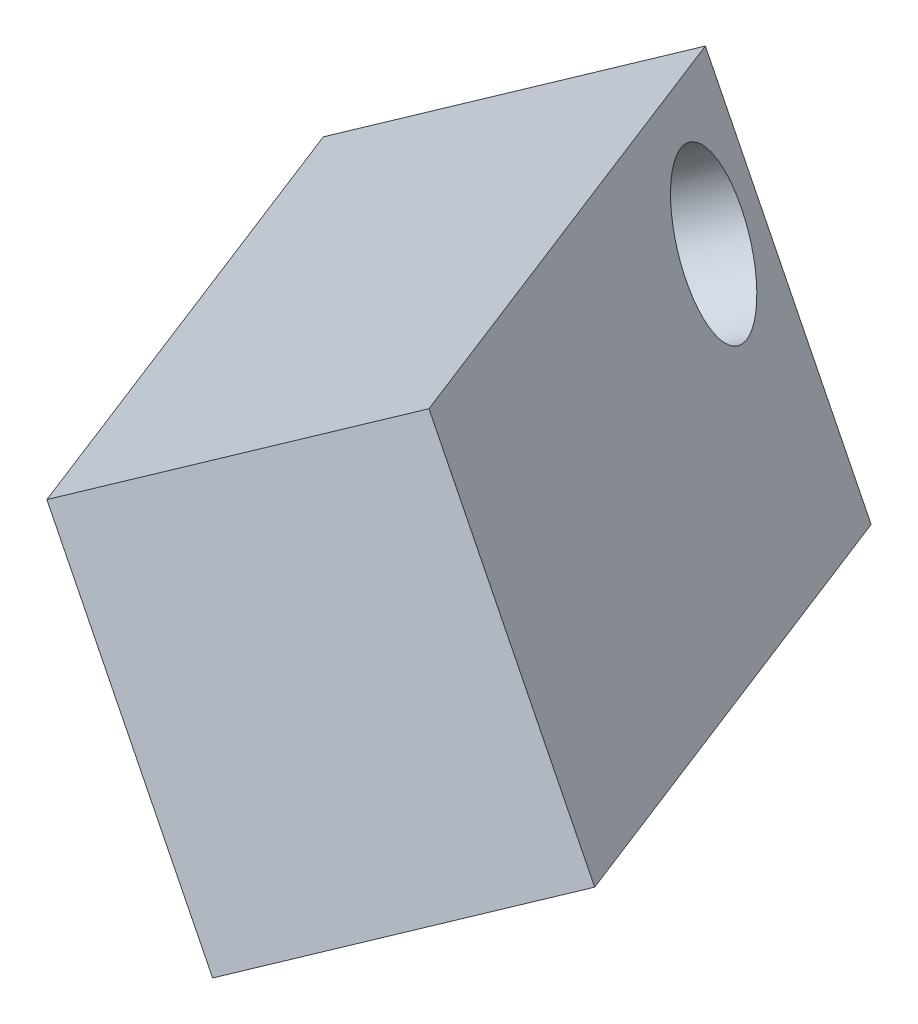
ISO-10303-21;
HEADER;
FILE_DESCRIPTION(('STEP AP214'),'2;1');
FILE_NAME('part.step','',(''),(''),'','','');
FILE_SCHEMA(('AUTOMOTIVE_DESIGN { 1 0 10303 214 1 1 1 1 }'));
ENDSEC;
DATA;
#1=APPLICATION_CONTEXT('core data for automotive mechanical design processes');
#2=APPLICATION_PROTOCOL_DEFINITION('international standard','automotive_design',2000,#1);
#3=PRODUCT_CONTEXT('',#1,'mechanical');
#4=PRODUCT('Part','Part','',(#3));
#5=PRODUCT_RELATED_PRODUCT_CATEGORY('part','',(#4));
#6=PRODUCT_DEFINITION_FORMATION('','',#4);
#7=PRODUCT_DEFINITION_CONTEXT('part definition',#1,'design');
#8=PRODUCT_DEFINITION('design','',#6,#7);
#9=PRODUCT_DEFINITION_SHAPE('','',#8);
#10=(LENGTH_UNIT() NAMED_UNIT(*) SI_UNIT(.MILLI.,.METRE.));
#11=(NAMED_UNIT(*) PLANE_ANGLE_UNIT() SI_UNIT($,.RADIAN.));
#12=(NAMED_UNIT(*) SI_UNIT($,.STERADIAN.) SOLID_ANGLE_UNIT());
#13=UNCERTAINTY_MEASURE_WITH_UNIT(LENGTH_MEASURE(1.E-05),#10,'distance_accuracy_value','');
#14=(GEOMETRIC_REPRESENTATION_CONTEXT(3) GLOBAL_UNCERTAINTY_ASSIGNED_CONTEXT((#13)) GLOBAL_UNIT_ASSIGNED_CONTEXT((#10,
#11,#12)) REPRESENTATION_CONTEXT('',''));
#15=CARTESIAN_POINT('',(0.,0.,0.));
#16=DIRECTION('',(0.,0.,1.));
#17=DIRECTION('',(1.,0.,0.));
#18=AXIS2_PLACEMENT_3D('',#15,#16,#17);
#19=CARTESIAN_POINT('',(-284.23101934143,-198.01720910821,273.60571419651));
#20=DIRECTION('',(0.447213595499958,-0.894427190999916,0.));
#21=DIRECTION('',(0.894427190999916,0.447213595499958,0.));
#22=AXIS2_PLACEMENT_3D('',#19,#20,#21);
#23=PLANE('',#22);
#24=DIRECTION('',(-0.474644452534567,-0.237322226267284,-0.847579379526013));
#25=VECTOR('',#24,1.);
#26=CARTESIAN_POINT('',(-253.907097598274,-182.855248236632,252.378968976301));
#27=LINE('',#26,#25);
#28=CARTESIAN_POINT('',(-206.442652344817,-159.123025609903,337.136906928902));
#29=VERTEX_POINT('',#28);
#30=CARTESIAN_POINT('',(-253.907097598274,-182.855248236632,252.378968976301));
#31=VERTEX_POINT('',#30);
#32=EDGE_CURVE('E108',#29,#31,#27,.T.);
#33=ORIENTED_EDGE('',*,*,#32,.T.);
#34=DIRECTION('',(0.758098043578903,0.379049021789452,-0.530668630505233));
#35=VECTOR('',#34,1.);
#36=CARTESIAN_POINT('',(-284.23101934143,-198.01720910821,273.60571419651));
#37=LINE('',#36,#35);
#38=CARTESIAN_POINT('',(-284.23101934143,-198.01720910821,273.60571419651));
#39=VERTEX_POINT('',#38);
#40=EDGE_CURVE('E11',#39,#31,#37,.T.);
#41=ORIENTED_EDGE('',*,*,#40,.F.);
#42=DIRECTION('',(-0.474644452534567,-0.237322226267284,-0.847579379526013));
#43=VECTOR('',#42,1.);
#44=CARTESIAN_POINT('',(-284.23101934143,-198.01720910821,273.60571419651));
#45=LINE('',#44,#43);
#46=CARTESIAN_POINT('',(-236.766574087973,-174.284986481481,358.363652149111));
#47=VERTEX_POINT('',#46);
#48=EDGE_CURVE('E96',#47,#39,#45,.T.);
#49=ORIENTED_EDGE('',*,*,#48,.F.);
#50=DIRECTION('',(0.758098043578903,0.379049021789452,-0.530668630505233));
#51=VECTOR('',#50,1.);
#52=CARTESIAN_POINT('',(-236.766574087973,-174.284986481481,358.363652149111));
#53=LINE('',#52,#51);
#54=EDGE_CURVE('E104',#47,#29,#53,.T.);
#55=ORIENTED_EDGE('',*,*,#54,.T.);
#56=EDGE_LOOP('',(#33,#41,#49,#55));
#57=FACE_BOUND('',#56,.T.);
#58=ADVANCED_FACE('F43',(#57),#23,.F.);
#59=CARTESIAN_POINT('',(-284.23101934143,-198.01720910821,273.60571419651));
#60=DIRECTION('',(0.474644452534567,0.237322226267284,0.847579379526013));
#61=DIRECTION('',(0.87250601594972,0.,-0.488603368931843));
#62=AXIS2_PLACEMENT_3D('',#59,#60,#61);
#63=PLANE('',#62);
#64=DIRECTION('',(0.447213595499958,-0.894427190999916,0.));
#65=VECTOR('',#64,1.);
#66=CARTESIAN_POINT('',(-253.907097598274,-182.855248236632,252.378968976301));
#67=LINE('',#66,#65);
#68=CARTESIAN_POINT('',(-231.546417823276,-227.576607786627,252.378968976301));
#69=VERTEX_POINT('',#68);
#70=EDGE_CURVE('E100',#31,#69,#67,.T.);
#71=ORIENTED_EDGE('',*,*,#70,.T.);
#72=DIRECTION('',(0.758098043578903,0.379049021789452,-0.530668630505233));
#73=VECTOR('',#72,1.);
#74=CARTESIAN_POINT('',(-261.870339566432,-242.738568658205,273.60571419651));
#75=LINE('',#74,#73);
#76=CARTESIAN_POINT('',(-261.870339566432,-242.738568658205,273.60571419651));
#77=VERTEX_POINT('',#76);
#78=EDGE_CURVE('E52',#77,#69,#75,.T.);
#79=ORIENTED_EDGE('',*,*,#78,.F.);
#80=DIRECTION('',(0.447213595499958,-0.894427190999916,0.));
#81=VECTOR('',#80,1.);
#82=CARTESIAN_POINT('',(-284.23101934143,-198.01720910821,273.60571419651));
#83=LINE('',#82,#81);
#84=EDGE_CURVE('E91',#39,#77,#83,.T.);
#85=ORIENTED_EDGE('',*,*,#84,.F.);
#86=ORIENTED_EDGE('',*,*,#40,.T.);
#87=EDGE_LOOP('',(#71,#79,#85,#86));
#88=FACE_BOUND('',#87,.T.);
#89=ADVANCED_FACE('F99',(#88),#63,.F.);
#90=CARTESIAN_POINT('',(-261.870339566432,-242.738568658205,273.60571419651));
#91=DIRECTION('',(-0.447213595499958,0.894427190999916,0.));
#92=DIRECTION('',(-0.894427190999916,-0.447213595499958,0.));
#93=AXIS2_PLACEMENT_3D('',#90,#91,#92);
#94=PLANE('',#93);
#95=DIRECTION('',(0.474644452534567,0.237322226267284,0.847579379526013));
#96=VECTOR('',#95,1.);
#97=CARTESIAN_POINT('',(-231.546417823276,-227.576607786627,252.378968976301));
#98=LINE('',#97,#96);
#99=CARTESIAN_POINT('',(-184.081972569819,-203.844385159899,337.136906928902));
#100=VERTEX_POINT('',#99);
#101=EDGE_CURVE('E78',#69,#100,#98,.T.);
#102=ORIENTED_EDGE('',*,*,#101,.T.);
#103=DIRECTION('',(0.758098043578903,0.379049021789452,-0.530668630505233));
#104=VECTOR('',#103,1.);
#105=CARTESIAN_POINT('',(-214.405894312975,-219.006346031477,358.363652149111));
#106=LINE('',#105,#104);
#107=CARTESIAN_POINT('',(-214.405894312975,-219.006346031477,358.363652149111));
#108=VERTEX_POINT('',#107);
#109=EDGE_CURVE('E101',#108,#100,#106,.T.);
#110=ORIENTED_EDGE('',*,*,#109,.F.);
#111=DIRECTION('',(0.474644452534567,0.237322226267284,0.847579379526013));
#112=VECTOR('',#111,1.);
#113=CARTESIAN_POINT('',(-261.870339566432,-242.738568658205,273.60571419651));
#114=LINE('',#113,#112);
#115=EDGE_CURVE('E94',#77,#108,#114,.T.);
#116=ORIENTED_EDGE('',*,*,#115,.F.);
#117=ORIENTED_EDGE('',*,*,#78,.T.);
#118=EDGE_LOOP('',(#102,#110,#116,#117));
#119=FACE_BOUND('',#118,.T.);
#120=ADVANCED_FACE('F102',(#119),#94,.F.);
#121=CARTESIAN_POINT('',(-236.766574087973,-174.284986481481,358.363652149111));
#122=DIRECTION('',(-0.474644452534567,-0.237322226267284,-0.847579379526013));
#123=DIRECTION('',(-0.87250601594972,0.,0.488603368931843));
#124=AXIS2_PLACEMENT_3D('',#121,#122,#123);
#125=PLANE('',#124);
#126=DIRECTION('',(-0.447213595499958,0.894427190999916,0.));
#127=VECTOR('',#126,1.);
#128=CARTESIAN_POINT('',(-206.442652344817,-159.123025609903,337.136906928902));
#129=LINE('',#128,#127);
#130=EDGE_CURVE('E84',#100,#29,#129,.T.);
#131=ORIENTED_EDGE('',*,*,#130,.T.);
#132=ORIENTED_EDGE('',*,*,#54,.F.);
#133=DIRECTION('',(-0.447213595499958,0.894427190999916,0.));
#134=VECTOR('',#133,1.);
#135=CARTESIAN_POINT('',(-236.766574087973,-174.284986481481,358.363652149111));
#136=LINE('',#135,#134);
#137=EDGE_CURVE('E60',#108,#47,#136,.T.);
#138=ORIENTED_EDGE('',*,*,#137,.F.);
#139=ORIENTED_EDGE('',*,*,#109,.T.);
#140=EDGE_LOOP('',(#131,#132,#138,#139));
#141=FACE_BOUND('',#140,.T.);
#142=ADVANCED_FACE('F121',(#141),#125,.F.);
#143=CARTESIAN_POINT('',(-236.766574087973,-174.284986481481,358.363652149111));
#144=DIRECTION('',(0.758098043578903,0.379049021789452,-0.530668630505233));
#145=DIRECTION('',(-0.573462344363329,0.,-0.81923192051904));
#146=AXIS2_PLACEMENT_3D('',#143,#144,#145);
#147=PLANE('',#146);
#148=CARTESIAN_POINT('',(-270.403148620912,-207.873783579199,286.3194048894));
#149=DIRECTION('',(0.758098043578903,0.379049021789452,-0.530668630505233));
#150=DIRECTION('',(-0.573462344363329,0.,-0.81923192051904));
#151=AXIS2_PLACEMENT_3D('',#148,#149,#150);
#152=CIRCLE('',#151,10.);
#153=CARTESIAN_POINT('',(-276.137772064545,-207.873783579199,278.12708568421));
#154=VERTEX_POINT('',#153);
#155=EDGE_CURVE('E112',#154,#154,#152,.T.);
#156=ORIENTED_EDGE('',*,*,#155,.T.);
#157=EDGE_LOOP('',(#156));
#158=FACE_BOUND('',#157,.T.);
#159=ORIENTED_EDGE('',*,*,#48,.T.);
#160=ORIENTED_EDGE('',*,*,#84,.T.);
#161=ORIENTED_EDGE('',*,*,#115,.T.);
#162=ORIENTED_EDGE('',*,*,#137,.T.);
#163=EDGE_LOOP('',(#159,#160,#161,#162));
#164=FACE_BOUND('',#163,.T.);
#165=ADVANCED_FACE('F92',(#158,#164),#147,.F.);
#166=CARTESIAN_POINT('',(-206.442652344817,-159.123025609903,337.136906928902));
#167=DIRECTION('',(0.758098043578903,0.379049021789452,-0.530668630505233));
#168=DIRECTION('',(-0.573462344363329,0.,-0.81923192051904));
#169=AXIS2_PLACEMENT_3D('',#166,#167,#168);
#170=PLANE('',#169);
#171=CARTESIAN_POINT('',(-240.079226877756,-192.711822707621,265.092659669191));
#172=DIRECTION('',(0.758098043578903,0.379049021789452,-0.530668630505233));
#173=DIRECTION('',(-0.573462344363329,0.,-0.81923192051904));
#174=AXIS2_PLACEMENT_3D('',#171,#172,#173);
#175=CIRCLE('',#174,10.);
#176=CARTESIAN_POINT('',(-245.813850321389,-192.711822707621,256.900340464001));
#177=VERTEX_POINT('',#176);
#178=EDGE_CURVE('E127',#177,#177,#175,.T.);
#179=ORIENTED_EDGE('',*,*,#178,.F.);
#180=EDGE_LOOP('',(#179));
#181=FACE_BOUND('',#180,.T.);
#182=ORIENTED_EDGE('',*,*,#32,.F.);
#183=ORIENTED_EDGE('',*,*,#130,.F.);
#184=ORIENTED_EDGE('',*,*,#101,.F.);
#185=ORIENTED_EDGE('',*,*,#70,.F.);
#186=EDGE_LOOP('',(#182,#183,#184,#185));
#187=FACE_BOUND('',#186,.T.);
#188=ADVANCED_FACE('F124',(#181,#187),#170,.T.);
#189=CARTESIAN_POINT('',(-270.403148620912,-207.873783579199,286.3194048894));
#190=DIRECTION('',(0.758098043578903,0.379049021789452,-0.530668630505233));
#191=DIRECTION('',(-0.573462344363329,0.,-0.81923192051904));
#192=AXIS2_PLACEMENT_3D('',#189,#190,#191);
#193=CYLINDRICAL_SURFACE('',#192,10.);
#194=ORIENTED_EDGE('',*,*,#155,.F.);
#195=EDGE_LOOP('',(#194));
#196=FACE_BOUND('',#195,.T.);
#197=ORIENTED_EDGE('',*,*,#178,.T.);
#198=EDGE_LOOP('',(#197));
#199=FACE_BOUND('',#198,.T.);
#200=ADVANCED_FACE('F134',(#196,#199),#193,.F.);
#201=CLOSED_SHELL('',(#58,#89,#120,#142,#165,#188,#200));
#202=MANIFOLD_SOLID_BREP('B2',#201);
#203=ADVANCED_BREP_SHAPE_REPRESENTATION('',(#18,#202),#14);
#204=SHAPE_DEFINITION_REPRESENTATION(#9,#203);
ENDSEC;
END-ISO-10303-21;
